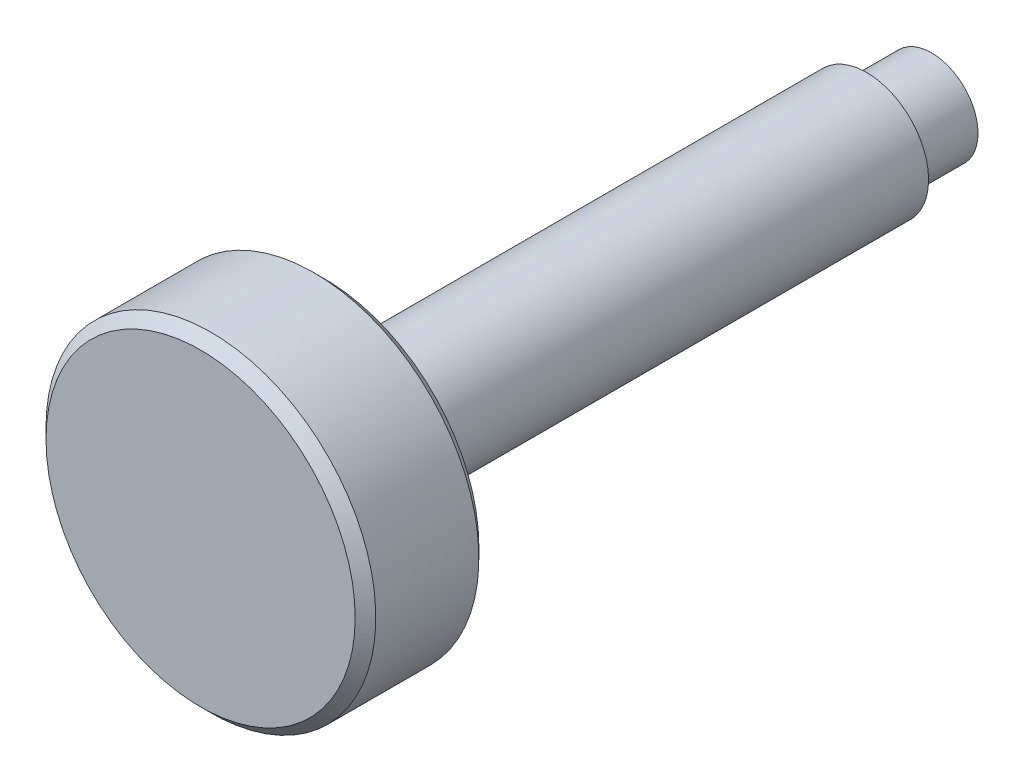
ISO-10303-21;
HEADER;
FILE_DESCRIPTION(('STEP AP214'),'2;1');
FILE_NAME('part.step','',(''),(''),'','','');
FILE_SCHEMA(('AUTOMOTIVE_DESIGN { 1 0 10303 214 1 1 1 1 }'));
ENDSEC;
DATA;
#1=APPLICATION_CONTEXT('core data for automotive mechanical design processes');
#2=APPLICATION_PROTOCOL_DEFINITION('international standard','automotive_design',2000,#1);
#3=PRODUCT_CONTEXT('',#1,'mechanical');
#4=PRODUCT('Part','Part','',(#3));
#5=PRODUCT_RELATED_PRODUCT_CATEGORY('part','',(#4));
#6=PRODUCT_DEFINITION_FORMATION('','',#4);
#7=PRODUCT_DEFINITION_CONTEXT('part definition',#1,'design');
#8=PRODUCT_DEFINITION('design','',#6,#7);
#9=PRODUCT_DEFINITION_SHAPE('','',#8);
#10=(LENGTH_UNIT() NAMED_UNIT(*) SI_UNIT(.MILLI.,.METRE.));
#11=(NAMED_UNIT(*) PLANE_ANGLE_UNIT() SI_UNIT($,.RADIAN.));
#12=(NAMED_UNIT(*) SI_UNIT($,.STERADIAN.) SOLID_ANGLE_UNIT());
#13=UNCERTAINTY_MEASURE_WITH_UNIT(LENGTH_MEASURE(1.E-05),#10,'distance_accuracy_value','');
#14=(GEOMETRIC_REPRESENTATION_CONTEXT(3) GLOBAL_UNCERTAINTY_ASSIGNED_CONTEXT((#13)) GLOBAL_UNIT_ASSIGNED_CONTEXT((#10,
#11,#12)) REPRESENTATION_CONTEXT('',''));
#15=CARTESIAN_POINT('',(0.,0.,0.));
#16=DIRECTION('',(0.,0.,1.));
#17=DIRECTION('',(1.,0.,0.));
#18=AXIS2_PLACEMENT_3D('',#15,#16,#17);
#19=CARTESIAN_POINT('',(0.,0.,60.));
#20=DIRECTION('',(0.,0.,1.));
#21=DIRECTION('',(1.,0.,0.));
#22=AXIS2_PLACEMENT_3D('',#19,#20,#21);
#23=CYLINDRICAL_SURFACE('',#22,16.);
#24=CARTESIAN_POINT('',(0.,0.,71.));
#25=DIRECTION('',(0.,0.,-1.));
#26=DIRECTION('',(-1.,0.,0.));
#27=AXIS2_PLACEMENT_3D('',#24,#25,#26);
#28=CIRCLE('',#27,16.);
#29=CARTESIAN_POINT('',(-16.,0.,71.));
#30=VERTEX_POINT('',#29);
#31=EDGE_CURVE('E23',#30,#30,#28,.T.);
#32=ORIENTED_EDGE('',*,*,#31,.T.);
#33=EDGE_LOOP('',(#32));
#34=FACE_BOUND('',#33,.T.);
#35=CARTESIAN_POINT('',(0.,0.,61.));
#36=DIRECTION('',(0.,0.,-1.));
#37=DIRECTION('',(-1.,0.,0.));
#38=AXIS2_PLACEMENT_3D('',#35,#36,#37);
#39=CIRCLE('',#38,16.);
#40=CARTESIAN_POINT('',(-16.,0.,61.));
#41=VERTEX_POINT('',#40);
#42=EDGE_CURVE('E27',#41,#41,#39,.F.);
#43=ORIENTED_EDGE('',*,*,#42,.T.);
#44=EDGE_LOOP('',(#43));
#45=FACE_BOUND('',#44,.T.);
#46=ADVANCED_FACE('F12',(#34,#45),#23,.T.);
#47=CARTESIAN_POINT('',(0.,0.,60.));
#48=DIRECTION('',(0.,0.,-1.));
#49=DIRECTION('',(-1.,0.,0.));
#50=AXIS2_PLACEMENT_3D('',#47,#48,#49);
#51=PLANE('',#50);
#52=CARTESIAN_POINT('',(0.,0.,60.));
#53=DIRECTION('',(0.,0.,-1.));
#54=DIRECTION('',(-1.,0.,0.));
#55=AXIS2_PLACEMENT_3D('',#52,#53,#54);
#56=CIRCLE('',#55,15.);
#57=CARTESIAN_POINT('',(-15.,0.,60.));
#58=VERTEX_POINT('',#57);
#59=EDGE_CURVE('E8',#58,#58,#56,.T.);
#60=ORIENTED_EDGE('',*,*,#59,.T.);
#61=EDGE_LOOP('',(#60));
#62=FACE_BOUND('',#61,.T.);
#63=CARTESIAN_POINT('',(0.,0.,60.));
#64=DIRECTION('',(0.,0.,-1.));
#65=DIRECTION('',(-1.,0.,0.));
#66=AXIS2_PLACEMENT_3D('',#63,#64,#65);
#67=CIRCLE('',#66,6.6);
#68=CARTESIAN_POINT('',(-6.6,0.,60.));
#69=VERTEX_POINT('',#68);
#70=EDGE_CURVE('E32',#69,#69,#67,.F.);
#71=ORIENTED_EDGE('',*,*,#70,.T.);
#72=EDGE_LOOP('',(#71));
#73=FACE_BOUND('',#72,.T.);
#74=ADVANCED_FACE('F66',(#62,#73),#51,.T.);
#75=CARTESIAN_POINT('',(0.,0.,72.));
#76=DIRECTION('',(0.,0.,-1.));
#77=DIRECTION('',(-1.,0.,0.));
#78=AXIS2_PLACEMENT_3D('',#75,#76,#77);
#79=PLANE('',#78);
#80=CARTESIAN_POINT('',(0.,0.,72.));
#81=DIRECTION('',(0.,0.,-1.));
#82=DIRECTION('',(-1.,0.,0.));
#83=AXIS2_PLACEMENT_3D('',#80,#81,#82);
#84=CIRCLE('',#83,15.);
#85=CARTESIAN_POINT('',(-15.,0.,72.));
#86=VERTEX_POINT('',#85);
#87=EDGE_CURVE('E19',#86,#86,#84,.F.);
#88=ORIENTED_EDGE('',*,*,#87,.T.);
#89=EDGE_LOOP('',(#88));
#90=FACE_BOUND('',#89,.T.);
#91=ADVANCED_FACE('F72',(#90),#79,.F.);
#92=CARTESIAN_POINT('',(0.,0.,60.));
#93=DIRECTION('',(0.,0.,1.));
#94=DIRECTION('',(1.,0.,0.));
#95=AXIS2_PLACEMENT_3D('',#92,#93,#94);
#96=CYLINDRICAL_SURFACE('',#95,6.);
#97=CARTESIAN_POINT('',(0.,0.,59.4));
#98=DIRECTION('',(0.,0.,-1.));
#99=DIRECTION('',(-1.,0.,0.));
#100=AXIS2_PLACEMENT_3D('',#97,#98,#99);
#101=CIRCLE('',#100,6.);
#102=CARTESIAN_POINT('',(-6.,0.,59.4));
#103=VERTEX_POINT('',#102);
#104=EDGE_CURVE('E35',#103,#103,#101,.T.);
#105=ORIENTED_EDGE('',*,*,#104,.T.);
#106=EDGE_LOOP('',(#105));
#107=FACE_BOUND('',#106,.T.);
#108=CARTESIAN_POINT('',(0.,0.,7.36602540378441));
#109=DIRECTION('',(0.,0.,1.));
#110=DIRECTION('',(1.,0.,0.));
#111=AXIS2_PLACEMENT_3D('',#108,#109,#110);
#112=CIRCLE('',#111,6.);
#113=CARTESIAN_POINT('',(6.,0.,7.36602540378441));
#114=VERTEX_POINT('',#113);
#115=EDGE_CURVE('E38',#114,#114,#112,.T.);
#116=ORIENTED_EDGE('',*,*,#115,.T.);
#117=EDGE_LOOP('',(#116));
#118=FACE_BOUND('',#117,.T.);
#119=ADVANCED_FACE('F125',(#107,#118),#96,.T.);
#120=CARTESIAN_POINT('',(0.,0.,7.36602540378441));
#121=DIRECTION('',(0.,0.,1.));
#122=DIRECTION('',(1.,0.,0.));
#123=AXIS2_PLACEMENT_3D('',#120,#121,#122);
#124=CONICAL_SURFACE('',#123,6.,1.0471975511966);
#125=CARTESIAN_POINT('',(0.,0.,6.5));
#126=DIRECTION('',(0.,0.,1.));
#127=DIRECTION('',(1.,0.,0.));
#128=AXIS2_PLACEMENT_3D('',#125,#126,#127);
#129=CIRCLE('',#128,4.5);
#130=CARTESIAN_POINT('',(4.5,0.,6.5));
#131=VERTEX_POINT('',#130);
#132=EDGE_CURVE('E41',#131,#131,#129,.T.);
#133=ORIENTED_EDGE('',*,*,#132,.T.);
#134=EDGE_LOOP('',(#133));
#135=FACE_BOUND('',#134,.T.);
#136=ORIENTED_EDGE('',*,*,#115,.F.);
#137=EDGE_LOOP('',(#136));
#138=FACE_BOUND('',#137,.T.);
#139=ADVANCED_FACE('F63',(#135,#138),#124,.T.);
#140=CARTESIAN_POINT('',(0.,0.,60.));
#141=DIRECTION('',(0.,0.,1.));
#142=DIRECTION('',(1.,0.,0.));
#143=AXIS2_PLACEMENT_3D('',#140,#141,#142);
#144=CYLINDRICAL_SURFACE('',#143,4.5);
#145=CARTESIAN_POINT('',(0.,0.,1.06971445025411));
#146=DIRECTION('',(0.,0.,1.));
#147=DIRECTION('',(1.,0.,0.));
#148=AXIS2_PLACEMENT_3D('',#145,#146,#147);
#149=CIRCLE('',#148,4.5);
#150=CARTESIAN_POINT('',(4.5,0.,1.06971445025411));
#151=VERTEX_POINT('',#150);
#152=EDGE_CURVE('E44',#151,#151,#149,.T.);
#153=ORIENTED_EDGE('',*,*,#152,.T.);
#154=EDGE_LOOP('',(#153));
#155=FACE_BOUND('',#154,.T.);
#156=ORIENTED_EDGE('',*,*,#132,.F.);
#157=EDGE_LOOP('',(#156));
#158=FACE_BOUND('',#157,.T.);
#159=ADVANCED_FACE('F48',(#155,#158),#144,.T.);
#160=CARTESIAN_POINT('',(0.,0.,10.));
#161=DIRECTION('',(0.,0.,1.));
#162=DIRECTION('',(1.,0.,0.));
#163=AXIS2_PLACEMENT_3D('',#160,#161,#162);
#164=SPHERICAL_SURFACE('',#163,10.);
#165=ORIENTED_EDGE('',*,*,#152,.F.);
#166=EDGE_LOOP('',(#165));
#167=FACE_BOUND('',#166,.T.);
#168=ADVANCED_FACE('F51',(#167),#164,.T.);
#169=CARTESIAN_POINT('',(0.,0.,59.4));
#170=DIRECTION('',(0.,0.,-1.));
#171=DIRECTION('',(-1.,0.,0.));
#172=AXIS2_PLACEMENT_3D('',#169,#170,#171);
#173=TOROIDAL_SURFACE('',#172,6.6,0.6);
#174=ORIENTED_EDGE('',*,*,#70,.F.);
#175=EDGE_LOOP('',(#174));
#176=FACE_BOUND('',#175,.T.);
#177=ORIENTED_EDGE('',*,*,#104,.F.);
#178=EDGE_LOOP('',(#177));
#179=FACE_BOUND('',#178,.T.);
#180=ADVANCED_FACE('F53',(#176,#179),#173,.F.);
#181=CARTESIAN_POINT('',(0.,0.,71.));
#182=DIRECTION('',(0.,0.,-1.));
#183=DIRECTION('',(-1.,0.,0.));
#184=AXIS2_PLACEMENT_3D('',#181,#182,#183);
#185=CONICAL_SURFACE('',#184,16.,0.78539816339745);
#186=ORIENTED_EDGE('',*,*,#87,.F.);
#187=EDGE_LOOP('',(#186));
#188=FACE_BOUND('',#187,.T.);
#189=ORIENTED_EDGE('',*,*,#31,.F.);
#190=EDGE_LOOP('',(#189));
#191=FACE_BOUND('',#190,.T.);
#192=ADVANCED_FACE('F60',(#188,#191),#185,.T.);
#193=CARTESIAN_POINT('',(0.,0.,60.));
#194=DIRECTION('',(0.,0.,1.));
#195=DIRECTION('',(1.,0.,0.));
#196=AXIS2_PLACEMENT_3D('',#193,#194,#195);
#197=CONICAL_SURFACE('',#196,15.,0.785398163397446);
#198=ORIENTED_EDGE('',*,*,#42,.F.);
#199=EDGE_LOOP('',(#198));
#200=FACE_BOUND('',#199,.T.);
#201=ORIENTED_EDGE('',*,*,#59,.F.);
#202=EDGE_LOOP('',(#201));
#203=FACE_BOUND('',#202,.T.);
#204=ADVANCED_FACE('F14',(#200,#203),#197,.T.);
#205=CLOSED_SHELL('',(#46,#74,#91,#119,#139,#159,#168,#180,#192,#204));
#206=MANIFOLD_SOLID_BREP('B1',#205);
#207=ADVANCED_BREP_SHAPE_REPRESENTATION('',(#18,#206),#14);
#208=SHAPE_DEFINITION_REPRESENTATION(#9,#207);
ENDSEC;
END-ISO-10303-21;
